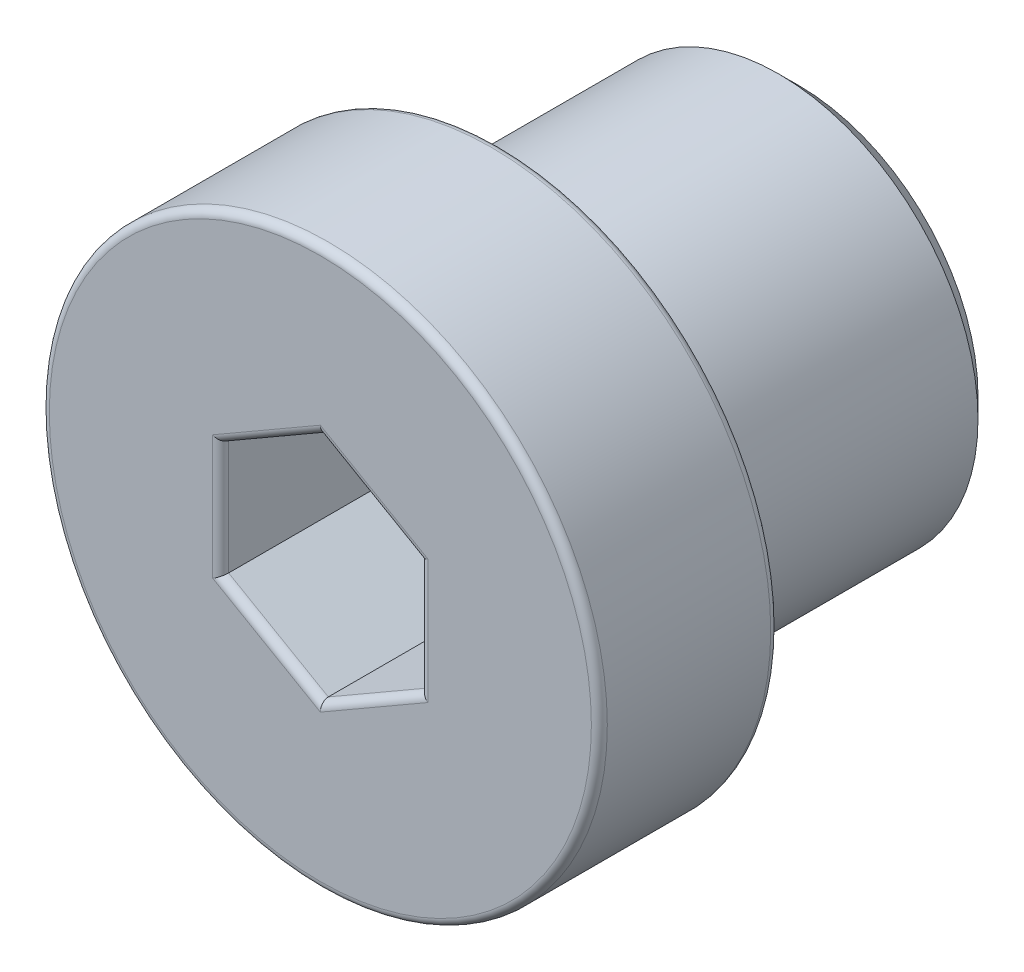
ISO-10303-21;
HEADER;
FILE_DESCRIPTION(('STEP AP214'),'2;1');
FILE_NAME('part.step','',(''),(''),'','','');
FILE_SCHEMA(('AUTOMOTIVE_DESIGN { 1 0 10303 214 1 1 1 1 }'));
ENDSEC;
DATA;
#1=APPLICATION_CONTEXT('core data for automotive mechanical design processes');
#2=APPLICATION_PROTOCOL_DEFINITION('international standard','automotive_design',2000,#1);
#3=PRODUCT_CONTEXT('',#1,'mechanical');
#4=PRODUCT('Part','Part','',(#3));
#5=PRODUCT_RELATED_PRODUCT_CATEGORY('part','',(#4));
#6=PRODUCT_DEFINITION_FORMATION('','',#4);
#7=PRODUCT_DEFINITION_CONTEXT('part definition',#1,'design');
#8=PRODUCT_DEFINITION('design','',#6,#7);
#9=PRODUCT_DEFINITION_SHAPE('','',#8);
#10=(LENGTH_UNIT() NAMED_UNIT(*) SI_UNIT(.MILLI.,.METRE.));
#11=(NAMED_UNIT(*) PLANE_ANGLE_UNIT() SI_UNIT($,.RADIAN.));
#12=(NAMED_UNIT(*) SI_UNIT($,.STERADIAN.) SOLID_ANGLE_UNIT());
#13=UNCERTAINTY_MEASURE_WITH_UNIT(LENGTH_MEASURE(1.E-05),#10,'distance_accuracy_value','');
#14=(GEOMETRIC_REPRESENTATION_CONTEXT(3) GLOBAL_UNCERTAINTY_ASSIGNED_CONTEXT((#13)) GLOBAL_UNIT_ASSIGNED_CONTEXT((#10,
#11,#12)) REPRESENTATION_CONTEXT('',''));
#15=CARTESIAN_POINT('',(0.,0.,0.));
#16=DIRECTION('',(0.,0.,1.));
#17=DIRECTION('',(1.,0.,0.));
#18=AXIS2_PLACEMENT_3D('',#15,#16,#17);
#19=CARTESIAN_POINT('',(-45.2,-13.,18.));
#20=DIRECTION('',(0.,0.,1.));
#21=DIRECTION('',(0.,-1.,0.));
#22=AXIS2_PLACEMENT_3D('',#19,#20,#21);
#23=PLANE('',#22);
#24=CARTESIAN_POINT('',(-45.2,-8.,17.999999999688));
#25=DIRECTION('',(0.,0.,1.));
#26=DIRECTION('',(1.,0.,0.));
#27=AXIS2_PLACEMENT_3D('',#24,#25,#26);
#28=CIRCLE('',#27,4.5000000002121);
#29=CARTESIAN_POINT('',(-40.6999999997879,-8.,17.999999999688));
#30=VERTEX_POINT('',#29);
#31=EDGE_CURVE('E133',#30,#30,#28,.T.);
#32=ORIENTED_EDGE('',*,*,#31,.F.);
#33=EDGE_LOOP('',(#32));
#34=FACE_BOUND('',#33,.T.);
#35=ADVANCED_FACE('F17',(#34),#23,.F.);
#36=CARTESIAN_POINT('',(-45.2,-8.,18.5000000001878));
#37=DIRECTION('',(0.,0.,1.));
#38=DIRECTION('',(1.,0.,0.));
#39=AXIS2_PLACEMENT_3D('',#36,#37,#38);
#40=CONICAL_SURFACE('',#39,4.99999999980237,0.785398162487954);
#41=ORIENTED_EDGE('',*,*,#31,.T.);
#42=EDGE_LOOP('',(#41));
#43=FACE_BOUND('',#42,.T.);
#44=CARTESIAN_POINT('',(-45.2,-8.,18.5000000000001));
#45=DIRECTION('',(0.,0.,-1.));
#46=DIRECTION('',(0.,1.,0.));
#47=AXIS2_PLACEMENT_3D('',#44,#45,#46);
#48=CIRCLE('',#47,5.);
#49=CARTESIAN_POINT('',(-45.2,-3.,18.5000000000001));
#50=VERTEX_POINT('',#49);
#51=EDGE_CURVE('E267',#50,#50,#48,.F.);
#52=ORIENTED_EDGE('',*,*,#51,.F.);
#53=EDGE_LOOP('',(#52));
#54=FACE_BOUND('',#53,.T.);
#55=ADVANCED_FACE('F460',(#43,#54),#40,.T.);
#56=CARTESIAN_POINT('',(-45.2,-8.,30.));
#57=DIRECTION('',(0.,0.,-1.));
#58=DIRECTION('',(0.,1.,0.));
#59=AXIS2_PLACEMENT_3D('',#56,#57,#58);
#60=CYLINDRICAL_SURFACE('',#59,5.);
#61=CARTESIAN_POINT('',(-45.2,-8.,24.5624999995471));
#62=DIRECTION('',(0.,0.,-1.));
#63=DIRECTION('',(-1.,0.,0.));
#64=AXIS2_PLACEMENT_3D('',#61,#62,#63);
#65=CIRCLE('',#64,4.9999999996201);
#66=CARTESIAN_POINT('',(-50.1999999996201,-8.,24.5624999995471));
#67=VERTEX_POINT('',#66);
#68=EDGE_CURVE('E264',#67,#67,#65,.F.);
#69=ORIENTED_EDGE('',*,*,#68,.F.);
#70=EDGE_LOOP('',(#69));
#71=FACE_BOUND('',#70,.T.);
#72=ORIENTED_EDGE('',*,*,#51,.T.);
#73=EDGE_LOOP('',(#72));
#74=FACE_BOUND('',#73,.T.);
#75=ADVANCED_FACE('F450',(#71,#74),#60,.T.);
#76=CARTESIAN_POINT('',(-45.2,-8.,24.5624999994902));
#77=DIRECTION('',(0.,0.,-1.));
#78=DIRECTION('',(-1.,0.,0.));
#79=AXIS2_PLACEMENT_3D('',#76,#77,#78);
#80=CONICAL_SURFACE('',#79,4.99999999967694,0.785398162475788);
#81=CARTESIAN_POINT('',(-45.2,-8.,25.4259500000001));
#82=DIRECTION('',(0.,0.,-1.));
#83=DIRECTION('',(0.,1.,0.));
#84=AXIS2_PLACEMENT_3D('',#81,#82,#83);
#85=CIRCLE('',#84,4.13655);
#86=CARTESIAN_POINT('',(-45.2,-3.86345,25.4259500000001));
#87=VERTEX_POINT('',#86);
#88=EDGE_CURVE('E255',#87,#87,#85,.F.);
#89=ORIENTED_EDGE('',*,*,#88,.F.);
#90=EDGE_LOOP('',(#89));
#91=FACE_BOUND('',#90,.T.);
#92=ORIENTED_EDGE('',*,*,#68,.T.);
#93=EDGE_LOOP('',(#92));
#94=FACE_BOUND('',#93,.T.);
#95=ADVANCED_FACE('F441',(#91,#94),#80,.T.);
#96=CARTESIAN_POINT('',(-45.2,-8.,30.));
#97=DIRECTION('',(0.,0.,-1.));
#98=DIRECTION('',(0.,1.,0.));
#99=AXIS2_PLACEMENT_3D('',#96,#97,#98);
#100=CYLINDRICAL_SURFACE('',#99,4.13655);
#101=CARTESIAN_POINT('',(-45.2,-8.,26.625));
#102=DIRECTION('',(0.,0.,-1.));
#103=DIRECTION('',(0.,1.,0.));
#104=AXIS2_PLACEMENT_3D('',#101,#102,#103);
#105=CIRCLE('',#104,4.13655);
#106=CARTESIAN_POINT('',(-45.2,-3.86345,26.625));
#107=VERTEX_POINT('',#106);
#108=EDGE_CURVE('E263',#107,#107,#105,.T.);
#109=ORIENTED_EDGE('',*,*,#108,.T.);
#110=EDGE_LOOP('',(#109));
#111=FACE_BOUND('',#110,.T.);
#112=ORIENTED_EDGE('',*,*,#88,.T.);
#113=EDGE_LOOP('',(#112));
#114=FACE_BOUND('',#113,.T.);
#115=ADVANCED_FACE('F294',(#111,#114),#100,.T.);
#116=CARTESIAN_POINT('',(-45.2,-14.,26.625));
#117=DIRECTION('',(0.,0.,1.));
#118=DIRECTION('',(0.,-1.,0.));
#119=AXIS2_PLACEMENT_3D('',#116,#117,#118);
#120=PLANE('',#119);
#121=ORIENTED_EDGE('',*,*,#108,.F.);
#122=EDGE_LOOP('',(#121));
#123=FACE_BOUND('',#122,.T.);
#124=CARTESIAN_POINT('',(-45.2,-8.,26.625));
#125=DIRECTION('',(0.,0.,-1.));
#126=DIRECTION('',(0.,1.,0.));
#127=AXIS2_PLACEMENT_3D('',#124,#125,#126);
#128=CIRCLE('',#127,6.);
#129=CARTESIAN_POINT('',(-45.2,-2.,26.625));
#130=VERTEX_POINT('',#129);
#131=EDGE_CURVE('E289',#130,#130,#128,.T.);
#132=ORIENTED_EDGE('',*,*,#131,.T.);
#133=EDGE_LOOP('',(#132));
#134=FACE_BOUND('',#133,.T.);
#135=ADVANCED_FACE('F297',(#123,#134),#120,.F.);
#136=CARTESIAN_POINT('',(-45.2,-8.,30.));
#137=DIRECTION('',(0.,0.,-1.));
#138=DIRECTION('',(0.,1.,0.));
#139=AXIS2_PLACEMENT_3D('',#136,#137,#138);
#140=CYLINDRICAL_SURFACE('',#139,6.);
#141=CARTESIAN_POINT('',(-45.2,-8.,25.5));
#142=DIRECTION('',(0.,0.,-1.));
#143=DIRECTION('',(0.,1.,0.));
#144=AXIS2_PLACEMENT_3D('',#141,#142,#143);
#145=CIRCLE('',#144,6.);
#146=CARTESIAN_POINT('',(-45.2,-2.,25.5));
#147=VERTEX_POINT('',#146);
#148=EDGE_CURVE('E247',#147,#147,#145,.T.);
#149=ORIENTED_EDGE('',*,*,#148,.T.);
#150=EDGE_LOOP('',(#149));
#151=FACE_BOUND('',#150,.T.);
#152=ORIENTED_EDGE('',*,*,#131,.F.);
#153=EDGE_LOOP('',(#152));
#154=FACE_BOUND('',#153,.T.);
#155=ADVANCED_FACE('F300',(#151,#154),#140,.F.);
#156=CARTESIAN_POINT('',(-45.2,-15.,25.5));
#157=DIRECTION('',(0.,0.,1.));
#158=DIRECTION('',(0.,-1.,0.));
#159=AXIS2_PLACEMENT_3D('',#156,#157,#158);
#160=PLANE('',#159);
#161=ORIENTED_EDGE('',*,*,#148,.F.);
#162=EDGE_LOOP('',(#161));
#163=FACE_BOUND('',#162,.T.);
#164=CARTESIAN_POINT('',(-45.2,-8.,25.5));
#165=DIRECTION('',(0.,0.,1.));
#166=DIRECTION('',(1.,0.,0.));
#167=AXIS2_PLACEMENT_3D('',#164,#165,#166);
#168=CIRCLE('',#167,6.80000000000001);
#169=CARTESIAN_POINT('',(-38.4,-8.,25.5));
#170=VERTEX_POINT('',#169);
#171=CARTESIAN_POINT('',(-52.,-8.,25.5));
#172=VERTEX_POINT('',#171);
#173=EDGE_CURVE('E243',#170,#172,#168,.T.);
#174=ORIENTED_EDGE('',*,*,#173,.F.);
#175=CARTESIAN_POINT('',(-45.2,-8.,25.5));
#176=DIRECTION('',(0.,0.,1.));
#177=DIRECTION('',(-1.,0.,0.));
#178=AXIS2_PLACEMENT_3D('',#175,#176,#177);
#179=CIRCLE('',#178,6.8);
#180=EDGE_CURVE('E220',#172,#170,#179,.T.);
#181=ORIENTED_EDGE('',*,*,#180,.F.);
#182=EDGE_LOOP('',(#174,#181));
#183=FACE_BOUND('',#182,.T.);
#184=ADVANCED_FACE('F230',(#163,#183),#160,.F.);
#185=CARTESIAN_POINT('',(-45.2,-8.,25.7));
#186=DIRECTION('',(0.,0.,1.));
#187=DIRECTION('',(1.,0.,0.));
#188=AXIS2_PLACEMENT_3D('',#185,#186,#187);
#189=TOROIDAL_SURFACE('',#188,6.8,0.2);
#190=ORIENTED_EDGE('',*,*,#173,.T.);
#191=ORIENTED_EDGE('',*,*,#180,.T.);
#192=EDGE_LOOP('',(#190,#191));
#193=FACE_BOUND('',#192,.T.);
#194=CARTESIAN_POINT('',(-45.2,-8.,25.7));
#195=DIRECTION('',(0.,0.,-1.));
#196=DIRECTION('',(0.,1.,0.));
#197=AXIS2_PLACEMENT_3D('',#194,#195,#196);
#198=CIRCLE('',#197,7.);
#199=CARTESIAN_POINT('',(-45.2,-1.,25.7));
#200=VERTEX_POINT('',#199);
#201=EDGE_CURVE('E217',#200,#200,#198,.F.);
#202=ORIENTED_EDGE('',*,*,#201,.F.);
#203=EDGE_LOOP('',(#202));
#204=FACE_BOUND('',#203,.T.);
#205=ADVANCED_FACE('F224',(#193,#204),#189,.T.);
#206=CARTESIAN_POINT('',(-45.2,-8.,30.));
#207=DIRECTION('',(0.,0.,-1.));
#208=DIRECTION('',(0.,1.,0.));
#209=AXIS2_PLACEMENT_3D('',#206,#207,#208);
#210=CYLINDRICAL_SURFACE('',#209,7.);
#211=ORIENTED_EDGE('',*,*,#201,.T.);
#212=EDGE_LOOP('',(#211));
#213=FACE_BOUND('',#212,.T.);
#214=CARTESIAN_POINT('',(-45.2,-8.,29.8));
#215=DIRECTION('',(0.,0.,-1.));
#216=DIRECTION('',(-1.,0.,0.));
#217=AXIS2_PLACEMENT_3D('',#214,#215,#216);
#218=CIRCLE('',#217,7.);
#219=CARTESIAN_POINT('',(-52.2,-8.,29.8));
#220=VERTEX_POINT('',#219);
#221=EDGE_CURVE('E203',#220,#220,#218,.F.);
#222=ORIENTED_EDGE('',*,*,#221,.F.);
#223=EDGE_LOOP('',(#222));
#224=FACE_BOUND('',#223,.T.);
#225=ADVANCED_FACE('F229',(#213,#224),#210,.T.);
#226=CARTESIAN_POINT('',(-42.7,-12.330127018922,24.666666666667));
#227=DIRECTION('',(0.,0.,-1.));
#228=DIRECTION('',(0.,1.,0.));
#229=AXIS2_PLACEMENT_3D('',#226,#227,#228);
#230=PLANE('',#229);
#231=DIRECTION('',(0.866025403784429,0.500000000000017,0.));
#232=VECTOR('',#231,1.);
#233=CARTESIAN_POINT('',(-47.7,-6.556624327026,24.666666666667));
#234=LINE('',#233,#232);
#235=CARTESIAN_POINT('',(-47.7,-6.55662432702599,24.666666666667));
#236=VERTEX_POINT('',#235);
#237=CARTESIAN_POINT('',(-45.2000000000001,-5.11324865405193,24.666666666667));
#238=VERTEX_POINT('',#237);
#239=EDGE_CURVE('E75',#236,#238,#234,.T.);
#240=ORIENTED_EDGE('',*,*,#239,.F.);
#241=DIRECTION('',(0.,1.,0.));
#242=VECTOR('',#241,1.);
#243=CARTESIAN_POINT('',(-47.7,-9.443375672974,24.666666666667));
#244=LINE('',#243,#242);
#245=CARTESIAN_POINT('',(-47.7,-9.44337567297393,24.666666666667));
#246=VERTEX_POINT('',#245);
#247=EDGE_CURVE('E201',#246,#236,#244,.T.);
#248=ORIENTED_EDGE('',*,*,#247,.F.);
#249=DIRECTION('',(-0.866025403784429,0.500000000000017,0.));
#250=VECTOR('',#249,1.);
#251=CARTESIAN_POINT('',(-45.2,-10.886751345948,24.666666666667));
#252=LINE('',#251,#250);
#253=CARTESIAN_POINT('',(-45.1999999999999,-10.8867513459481,24.666666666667));
#254=VERTEX_POINT('',#253);
#255=EDGE_CURVE('E192',#254,#246,#252,.T.);
#256=ORIENTED_EDGE('',*,*,#255,.F.);
#257=DIRECTION('',(-0.866025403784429,-0.500000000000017,0.));
#258=VECTOR('',#257,1.);
#259=CARTESIAN_POINT('',(-42.7,-9.443375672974,24.666666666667));
#260=LINE('',#259,#258);
#261=CARTESIAN_POINT('',(-42.7,-9.443375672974,24.666666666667));
#262=VERTEX_POINT('',#261);
#263=EDGE_CURVE('E188',#262,#254,#260,.T.);
#264=ORIENTED_EDGE('',*,*,#263,.F.);
#265=DIRECTION('',(0.,-1.,0.));
#266=VECTOR('',#265,1.);
#267=CARTESIAN_POINT('',(-42.7,-6.556624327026,24.666666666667));
#268=LINE('',#267,#266);
#269=CARTESIAN_POINT('',(-42.7,-6.55662432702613,24.666666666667));
#270=VERTEX_POINT('',#269);
#271=EDGE_CURVE('E183',#270,#262,#268,.T.);
#272=ORIENTED_EDGE('',*,*,#271,.F.);
#273=DIRECTION('',(0.866025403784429,-0.500000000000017,0.));
#274=VECTOR('',#273,1.);
#275=CARTESIAN_POINT('',(-45.2,-5.113248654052,24.666666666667));
#276=LINE('',#275,#274);
#277=EDGE_CURVE('E178',#238,#270,#276,.T.);
#278=ORIENTED_EDGE('',*,*,#277,.F.);
#279=EDGE_LOOP('',(#240,#248,#256,#264,#272,#278));
#280=FACE_BOUND('',#279,.T.);
#281=ADVANCED_FACE('F374',(#280),#230,.F.);
#282=CARTESIAN_POINT('',(-47.7,-9.443375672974,24.666666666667));
#283=DIRECTION('',(1.,0.,0.));
#284=DIRECTION('',(0.,1.,0.));
#285=AXIS2_PLACEMENT_3D('',#282,#283,#284);
#286=PLANE('',#285);
#287=ORIENTED_EDGE('',*,*,#247,.T.);
#288=DIRECTION('',(0.,0.,1.));
#289=VECTOR('',#288,1.);
#290=CARTESIAN_POINT('',(-47.7,-6.55662432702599,24.666666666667));
#291=LINE('',#290,#289);
#292=CARTESIAN_POINT('',(-47.7,-6.55662432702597,29.8));
#293=VERTEX_POINT('',#292);
#294=EDGE_CURVE('E164',#293,#236,#291,.F.);
#295=ORIENTED_EDGE('',*,*,#294,.F.);
#296=DIRECTION('',(0.,-1.,0.));
#297=VECTOR('',#296,1.);
#298=CARTESIAN_POINT('',(-47.7,-8.,29.8));
#299=LINE('',#298,#297);
#300=CARTESIAN_POINT('',(-47.7,-9.44337567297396,29.8));
#301=VERTEX_POINT('',#300);
#302=EDGE_CURVE('E108',#301,#293,#299,.F.);
#303=ORIENTED_EDGE('',*,*,#302,.F.);
#304=DIRECTION('',(0.,0.,1.));
#305=VECTOR('',#304,1.);
#306=CARTESIAN_POINT('',(-47.7,-9.44337567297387,24.666666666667));
#307=LINE('',#306,#305);
#308=EDGE_CURVE('E66',#246,#301,#307,.T.);
#309=ORIENTED_EDGE('',*,*,#308,.F.);
#310=EDGE_LOOP('',(#287,#295,#303,#309));
#311=FACE_BOUND('',#310,.T.);
#312=ADVANCED_FACE('F359',(#311),#286,.T.);
#313=CARTESIAN_POINT('',(-45.2,-10.886751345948,24.666666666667));
#314=DIRECTION('',(0.500000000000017,0.866025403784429,0.));
#315=DIRECTION('',(-0.866025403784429,0.500000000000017,0.));
#316=AXIS2_PLACEMENT_3D('',#313,#314,#315);
#317=PLANE('',#316);
#318=ORIENTED_EDGE('',*,*,#255,.T.);
#319=ORIENTED_EDGE('',*,*,#308,.T.);
#320=DIRECTION('',(0.866025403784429,-0.500000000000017,0.));
#321=VECTOR('',#320,1.);
#322=CARTESIAN_POINT('',(-46.45,-10.1650635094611,29.8));
#323=LINE('',#322,#321);
#324=CARTESIAN_POINT('',(-45.2,-10.8867513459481,29.8));
#325=VERTEX_POINT('',#324);
#326=EDGE_CURVE('E286',#325,#301,#323,.F.);
#327=ORIENTED_EDGE('',*,*,#326,.F.);
#328=DIRECTION('',(0.,0.,1.));
#329=VECTOR('',#328,1.);
#330=CARTESIAN_POINT('',(-45.1999999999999,-10.8867513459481,24.666666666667));
#331=LINE('',#330,#329);
#332=EDGE_CURVE('E186',#254,#325,#331,.T.);
#333=ORIENTED_EDGE('',*,*,#332,.F.);
#334=EDGE_LOOP('',(#318,#319,#327,#333));
#335=FACE_BOUND('',#334,.T.);
#336=ADVANCED_FACE('F371',(#335),#317,.T.);
#337=CARTESIAN_POINT('',(-42.7,-9.443375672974,24.666666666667));
#338=DIRECTION('',(-0.500000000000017,0.866025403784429,0.));
#339=DIRECTION('',(-0.866025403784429,-0.500000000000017,0.));
#340=AXIS2_PLACEMENT_3D('',#337,#338,#339);
#341=PLANE('',#340);
#342=ORIENTED_EDGE('',*,*,#263,.T.);
#343=ORIENTED_EDGE('',*,*,#332,.T.);
#344=DIRECTION('',(0.866025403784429,0.500000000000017,0.));
#345=VECTOR('',#344,1.);
#346=CARTESIAN_POINT('',(-43.95,-10.1650635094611,29.8));
#347=LINE('',#346,#345);
#348=CARTESIAN_POINT('',(-42.7,-9.44337567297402,29.8));
#349=VERTEX_POINT('',#348);
#350=EDGE_CURVE('E282',#349,#325,#347,.F.);
#351=ORIENTED_EDGE('',*,*,#350,.F.);
#352=DIRECTION('',(0.,0.,1.));
#353=VECTOR('',#352,1.);
#354=CARTESIAN_POINT('',(-42.7,-9.443375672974,24.666666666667));
#355=LINE('',#354,#353);
#356=EDGE_CURVE('E181',#262,#349,#355,.T.);
#357=ORIENTED_EDGE('',*,*,#356,.F.);
#358=EDGE_LOOP('',(#342,#343,#351,#357));
#359=FACE_BOUND('',#358,.T.);
#360=ADVANCED_FACE('F368',(#359),#341,.T.);
#361=CARTESIAN_POINT('',(-42.7,-6.556624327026,24.666666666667));
#362=DIRECTION('',(-1.,0.,0.));
#363=DIRECTION('',(0.,-1.,0.));
#364=AXIS2_PLACEMENT_3D('',#361,#362,#363);
#365=PLANE('',#364);
#366=ORIENTED_EDGE('',*,*,#271,.T.);
#367=ORIENTED_EDGE('',*,*,#356,.T.);
#368=DIRECTION('',(0.,1.,0.));
#369=VECTOR('',#368,1.);
#370=CARTESIAN_POINT('',(-42.7,-8.,29.8));
#371=LINE('',#370,#369);
#372=CARTESIAN_POINT('',(-42.7,-6.55662432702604,29.8));
#373=VERTEX_POINT('',#372);
#374=EDGE_CURVE('E279',#373,#349,#371,.F.);
#375=ORIENTED_EDGE('',*,*,#374,.F.);
#376=DIRECTION('',(0.,0.,1.));
#377=VECTOR('',#376,1.);
#378=CARTESIAN_POINT('',(-42.7,-6.55662432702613,24.666666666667));
#379=LINE('',#378,#377);
#380=EDGE_CURVE('E171',#270,#373,#379,.T.);
#381=ORIENTED_EDGE('',*,*,#380,.F.);
#382=EDGE_LOOP('',(#366,#367,#375,#381));
#383=FACE_BOUND('',#382,.T.);
#384=ADVANCED_FACE('F385',(#383),#365,.T.);
#385=CARTESIAN_POINT('',(-45.2,-5.113248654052,24.666666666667));
#386=DIRECTION('',(-0.500000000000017,-0.866025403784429,0.));
#387=DIRECTION('',(0.866025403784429,-0.500000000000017,0.));
#388=AXIS2_PLACEMENT_3D('',#385,#386,#387);
#389=PLANE('',#388);
#390=ORIENTED_EDGE('',*,*,#277,.T.);
#391=ORIENTED_EDGE('',*,*,#380,.T.);
#392=DIRECTION('',(-0.866025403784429,0.500000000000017,0.));
#393=VECTOR('',#392,1.);
#394=CARTESIAN_POINT('',(-43.95,-5.83493649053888,29.8));
#395=LINE('',#394,#393);
#396=CARTESIAN_POINT('',(-45.2000000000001,-5.11324865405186,29.8));
#397=VERTEX_POINT('',#396);
#398=EDGE_CURVE('E276',#397,#373,#395,.F.);
#399=ORIENTED_EDGE('',*,*,#398,.F.);
#400=DIRECTION('',(0.,0.,1.));
#401=VECTOR('',#400,1.);
#402=CARTESIAN_POINT('',(-45.2000000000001,-5.11324865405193,24.666666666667));
#403=LINE('',#402,#401);
#404=EDGE_CURVE('E112',#238,#397,#403,.T.);
#405=ORIENTED_EDGE('',*,*,#404,.F.);
#406=EDGE_LOOP('',(#390,#391,#399,#405));
#407=FACE_BOUND('',#406,.T.);
#408=ADVANCED_FACE('F377',(#407),#389,.T.);
#409=CARTESIAN_POINT('',(-47.7,-6.556624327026,24.666666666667));
#410=DIRECTION('',(0.500000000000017,-0.866025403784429,0.));
#411=DIRECTION('',(0.866025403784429,0.500000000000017,0.));
#412=AXIS2_PLACEMENT_3D('',#409,#410,#411);
#413=PLANE('',#412);
#414=ORIENTED_EDGE('',*,*,#239,.T.);
#415=ORIENTED_EDGE('',*,*,#404,.T.);
#416=DIRECTION('',(-0.866025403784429,-0.500000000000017,0.));
#417=VECTOR('',#416,1.);
#418=CARTESIAN_POINT('',(-46.45,-5.83493649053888,29.8));
#419=LINE('',#418,#417);
#420=EDGE_CURVE('E273',#293,#397,#419,.F.);
#421=ORIENTED_EDGE('',*,*,#420,.F.);
#422=ORIENTED_EDGE('',*,*,#294,.T.);
#423=EDGE_LOOP('',(#414,#415,#421,#422));
#424=FACE_BOUND('',#423,.T.);
#425=ADVANCED_FACE('F152',(#424),#413,.T.);
#426=CARTESIAN_POINT('',(-45.2,-8.,29.8));
#427=DIRECTION('',(0.,0.,-1.));
#428=DIRECTION('',(-1.,0.,0.));
#429=AXIS2_PLACEMENT_3D('',#426,#427,#428);
#430=TOROIDAL_SURFACE('',#429,6.8,0.2);
#431=ORIENTED_EDGE('',*,*,#221,.T.);
#432=EDGE_LOOP('',(#431));
#433=FACE_BOUND('',#432,.T.);
#434=CARTESIAN_POINT('',(-45.2,-8.,30.));
#435=DIRECTION('',(0.,0.,-1.));
#436=DIRECTION('',(1.,0.,0.));
#437=AXIS2_PLACEMENT_3D('',#434,#435,#436);
#438=CIRCLE('',#437,6.8);
#439=CARTESIAN_POINT('',(-38.4,-8.,30.));
#440=VERTEX_POINT('',#439);
#441=CARTESIAN_POINT('',(-52.,-8.,30.));
#442=VERTEX_POINT('',#441);
#443=EDGE_CURVE('E120',#440,#442,#438,.T.);
#444=ORIENTED_EDGE('',*,*,#443,.T.);
#445=CARTESIAN_POINT('',(-45.2,-8.,30.));
#446=DIRECTION('',(0.,0.,-1.));
#447=DIRECTION('',(-1.,0.,0.));
#448=AXIS2_PLACEMENT_3D('',#445,#446,#447);
#449=CIRCLE('',#448,6.8);
#450=EDGE_CURVE('E117',#442,#440,#449,.T.);
#451=ORIENTED_EDGE('',*,*,#450,.T.);
#452=EDGE_LOOP('',(#444,#451));
#453=FACE_BOUND('',#452,.T.);
#454=ADVANCED_FACE('F129',(#433,#453),#430,.T.);
#455=CARTESIAN_POINT('',(-47.9,-8.,29.8));
#456=DIRECTION('',(0.,-1.,0.));
#457=DIRECTION('',(0.,0.,-1.));
#458=AXIS2_PLACEMENT_3D('',#455,#456,#457);
#459=CYLINDRICAL_SURFACE('',#458,0.2);
#460=DIRECTION('',(0.,1.,0.));
#461=VECTOR('',#460,1.);
#462=CARTESIAN_POINT('',(-47.9,-8.,30.));
#463=LINE('',#462,#461);
#464=CARTESIAN_POINT('',(-47.9,-6.44115427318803,30.));
#465=VERTEX_POINT('',#464);
#466=CARTESIAN_POINT('',(-47.9,-9.55884572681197,30.));
#467=VERTEX_POINT('',#466);
#468=EDGE_CURVE('E125',#465,#467,#463,.F.);
#469=ORIENTED_EDGE('',*,*,#468,.T.);
#470=CARTESIAN_POINT('',(-47.9,-9.55884572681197,29.8));
#471=DIRECTION('',(0.499999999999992,-0.866025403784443,0.));
#472=DIRECTION('',(-0.866025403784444,-0.499999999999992,0.));
#473=AXIS2_PLACEMENT_3D('',#470,#471,#472);
#474=ELLIPSE('',#473,0.230940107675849,0.2);
#475=EDGE_CURVE('E283',#301,#467,#474,.T.);
#476=ORIENTED_EDGE('',*,*,#475,.F.);
#477=ORIENTED_EDGE('',*,*,#302,.T.);
#478=CARTESIAN_POINT('',(-47.9,-6.44115427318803,29.8));
#479=DIRECTION('',(-0.499999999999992,-0.866025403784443,0.));
#480=DIRECTION('',(-0.866025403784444,0.499999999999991,0.));
#481=AXIS2_PLACEMENT_3D('',#478,#479,#480);
#482=ELLIPSE('',#481,0.230940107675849,0.2);
#483=EDGE_CURVE('E130',#465,#293,#482,.F.);
#484=ORIENTED_EDGE('',*,*,#483,.F.);
#485=EDGE_LOOP('',(#469,#476,#477,#484));
#486=FACE_BOUND('',#485,.T.);
#487=ADVANCED_FACE('F151',(#486),#459,.T.);
#488=CARTESIAN_POINT('',(-46.55,-10.338268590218,29.8));
#489=DIRECTION('',(0.866025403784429,-0.500000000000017,0.));
#490=DIRECTION('',(0.500000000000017,0.866025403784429,0.));
#491=AXIS2_PLACEMENT_3D('',#488,#489,#490);
#492=CYLINDRICAL_SURFACE('',#491,0.2);
#493=DIRECTION('',(0.866025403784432,-0.500000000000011,0.));
#494=VECTOR('',#493,1.);
#495=CARTESIAN_POINT('',(-47.9,-9.55884572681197,30.));
#496=LINE('',#495,#494);
#497=CARTESIAN_POINT('',(-45.2,-11.117691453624,30.));
#498=VERTEX_POINT('',#497);
#499=EDGE_CURVE('E340',#467,#498,#496,.T.);
#500=ORIENTED_EDGE('',*,*,#499,.T.);
#501=CARTESIAN_POINT('',(-45.2,-11.117691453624,29.8));
#502=DIRECTION('',(1.,0.,0.));
#503=DIRECTION('',(0.,-1.,0.));
#504=AXIS2_PLACEMENT_3D('',#501,#502,#503);
#505=ELLIPSE('',#504,0.230940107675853,0.2);
#506=EDGE_CURVE('E280',#325,#498,#505,.T.);
#507=ORIENTED_EDGE('',*,*,#506,.F.);
#508=ORIENTED_EDGE('',*,*,#326,.T.);
#509=ORIENTED_EDGE('',*,*,#475,.T.);
#510=EDGE_LOOP('',(#500,#507,#508,#509));
#511=FACE_BOUND('',#510,.T.);
#512=ADVANCED_FACE('F355',(#511),#492,.T.);
#513=CARTESIAN_POINT('',(-43.85,-10.338268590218,29.8));
#514=DIRECTION('',(0.866025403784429,0.500000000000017,0.));
#515=DIRECTION('',(-0.500000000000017,0.866025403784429,0.));
#516=AXIS2_PLACEMENT_3D('',#513,#514,#515);
#517=CYLINDRICAL_SURFACE('',#516,0.2);
#518=DIRECTION('',(0.866025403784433,0.50000000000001,0.));
#519=VECTOR('',#518,1.);
#520=CARTESIAN_POINT('',(-45.2,-11.117691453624,30.));
#521=LINE('',#520,#519);
#522=CARTESIAN_POINT('',(-42.5,-9.55884572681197,30.));
#523=VERTEX_POINT('',#522);
#524=EDGE_CURVE('E345',#498,#523,#521,.T.);
#525=ORIENTED_EDGE('',*,*,#524,.T.);
#526=CARTESIAN_POINT('',(-42.5,-9.55884572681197,29.8));
#527=DIRECTION('',(0.499999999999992,0.866025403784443,0.));
#528=DIRECTION('',(0.866025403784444,-0.499999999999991,0.));
#529=AXIS2_PLACEMENT_3D('',#526,#527,#528);
#530=ELLIPSE('',#529,0.230940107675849,0.2);
#531=EDGE_CURVE('E277',#349,#523,#530,.T.);
#532=ORIENTED_EDGE('',*,*,#531,.F.);
#533=ORIENTED_EDGE('',*,*,#350,.T.);
#534=ORIENTED_EDGE('',*,*,#506,.T.);
#535=EDGE_LOOP('',(#525,#532,#533,#534));
#536=FACE_BOUND('',#535,.T.);
#537=ADVANCED_FACE('F364',(#536),#517,.T.);
#538=CARTESIAN_POINT('',(-42.5,-8.,29.8));
#539=DIRECTION('',(0.,1.,0.));
#540=DIRECTION('',(0.,0.,1.));
#541=AXIS2_PLACEMENT_3D('',#538,#539,#540);
#542=CYLINDRICAL_SURFACE('',#541,0.2);
#543=ORIENTED_EDGE('',*,*,#374,.T.);
#544=ORIENTED_EDGE('',*,*,#531,.T.);
#545=DIRECTION('',(0.,1.,0.));
#546=VECTOR('',#545,1.);
#547=CARTESIAN_POINT('',(-42.5,-8.,30.));
#548=LINE('',#547,#546);
#549=CARTESIAN_POINT('',(-42.5,-6.44115427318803,30.));
#550=VERTEX_POINT('',#549);
#551=EDGE_CURVE('E336',#523,#550,#548,.T.);
#552=ORIENTED_EDGE('',*,*,#551,.T.);
#553=CARTESIAN_POINT('',(-42.5,-6.44115427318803,29.8));
#554=DIRECTION('',(-0.499999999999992,0.866025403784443,0.));
#555=DIRECTION('',(0.866025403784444,0.499999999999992,0.));
#556=AXIS2_PLACEMENT_3D('',#553,#554,#555);
#557=ELLIPSE('',#556,0.230940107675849,0.2);
#558=EDGE_CURVE('E274',#373,#550,#557,.T.);
#559=ORIENTED_EDGE('',*,*,#558,.F.);
#560=EDGE_LOOP('',(#543,#544,#552,#559));
#561=FACE_BOUND('',#560,.T.);
#562=ADVANCED_FACE('F383',(#561),#542,.T.);
#563=CARTESIAN_POINT('',(-43.85,-5.661731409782,29.8));
#564=DIRECTION('',(-0.866025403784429,0.500000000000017,0.));
#565=DIRECTION('',(-0.500000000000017,-0.866025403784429,0.));
#566=AXIS2_PLACEMENT_3D('',#563,#564,#565);
#567=CYLINDRICAL_SURFACE('',#566,0.2);
#568=ORIENTED_EDGE('',*,*,#398,.T.);
#569=ORIENTED_EDGE('',*,*,#558,.T.);
#570=DIRECTION('',(-0.866025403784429,0.500000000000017,0.));
#571=VECTOR('',#570,1.);
#572=CARTESIAN_POINT('',(-42.5,-6.44115427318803,30.));
#573=LINE('',#572,#571);
#574=CARTESIAN_POINT('',(-45.2,-4.88230854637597,30.));
#575=VERTEX_POINT('',#574);
#576=EDGE_CURVE('E28',#550,#575,#573,.T.);
#577=ORIENTED_EDGE('',*,*,#576,.T.);
#578=CARTESIAN_POINT('',(-45.2,-4.88230854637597,29.8));
#579=DIRECTION('',(-1.,0.,0.));
#580=DIRECTION('',(0.,1.,0.));
#581=AXIS2_PLACEMENT_3D('',#578,#579,#580);
#582=ELLIPSE('',#581,0.230940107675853,0.2);
#583=EDGE_CURVE('E36',#397,#575,#582,.T.);
#584=ORIENTED_EDGE('',*,*,#583,.F.);
#585=EDGE_LOOP('',(#568,#569,#577,#584));
#586=FACE_BOUND('',#585,.T.);
#587=ADVANCED_FACE('F318',(#586),#567,.T.);
#588=CARTESIAN_POINT('',(-46.55,-5.661731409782,29.8));
#589=DIRECTION('',(-0.866025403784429,-0.500000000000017,0.));
#590=DIRECTION('',(0.500000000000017,-0.866025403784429,0.));
#591=AXIS2_PLACEMENT_3D('',#588,#589,#590);
#592=CYLINDRICAL_SURFACE('',#591,0.2);
#593=DIRECTION('',(-0.866025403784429,-0.500000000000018,0.));
#594=VECTOR('',#593,1.);
#595=CARTESIAN_POINT('',(-45.2,-4.88230854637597,30.));
#596=LINE('',#595,#594);
#597=EDGE_CURVE('E11',#575,#465,#596,.T.);
#598=ORIENTED_EDGE('',*,*,#597,.T.);
#599=ORIENTED_EDGE('',*,*,#483,.T.);
#600=ORIENTED_EDGE('',*,*,#420,.T.);
#601=ORIENTED_EDGE('',*,*,#583,.T.);
#602=EDGE_LOOP('',(#598,#599,#600,#601));
#603=FACE_BOUND('',#602,.T.);
#604=ADVANCED_FACE('F312',(#603),#592,.T.);
#605=CARTESIAN_POINT('',(-45.2,-8.,30.));
#606=DIRECTION('',(0.,0.,-1.));
#607=DIRECTION('',(0.,1.,0.));
#608=AXIS2_PLACEMENT_3D('',#605,#606,#607);
#609=PLANE('',#608);
#610=ORIENTED_EDGE('',*,*,#576,.F.);
#611=ORIENTED_EDGE('',*,*,#551,.F.);
#612=ORIENTED_EDGE('',*,*,#524,.F.);
#613=ORIENTED_EDGE('',*,*,#499,.F.);
#614=ORIENTED_EDGE('',*,*,#468,.F.);
#615=ORIENTED_EDGE('',*,*,#597,.F.);
#616=EDGE_LOOP('',(#610,#611,#612,#613,#614,#615));
#617=FACE_BOUND('',#616,.T.);
#618=ORIENTED_EDGE('',*,*,#450,.F.);
#619=ORIENTED_EDGE('',*,*,#443,.F.);
#620=EDGE_LOOP('',(#618,#619));
#621=FACE_BOUND('',#620,.T.);
#622=ADVANCED_FACE('F122',(#617,#621),#609,.F.);
#623=CLOSED_SHELL('',(#35,#55,#75,#95,#115,#135,#155,#184,#205,#225,#281,#312,#336,#360,#384,
#408,#425,#454,#487,#512,#537,#562,#587,#604,#622));
#624=MANIFOLD_SOLID_BREP('B1',#623);
#625=ADVANCED_BREP_SHAPE_REPRESENTATION('',(#18,#624),#14);
#626=SHAPE_DEFINITION_REPRESENTATION(#9,#625);
ENDSEC;
END-ISO-10303-21;
